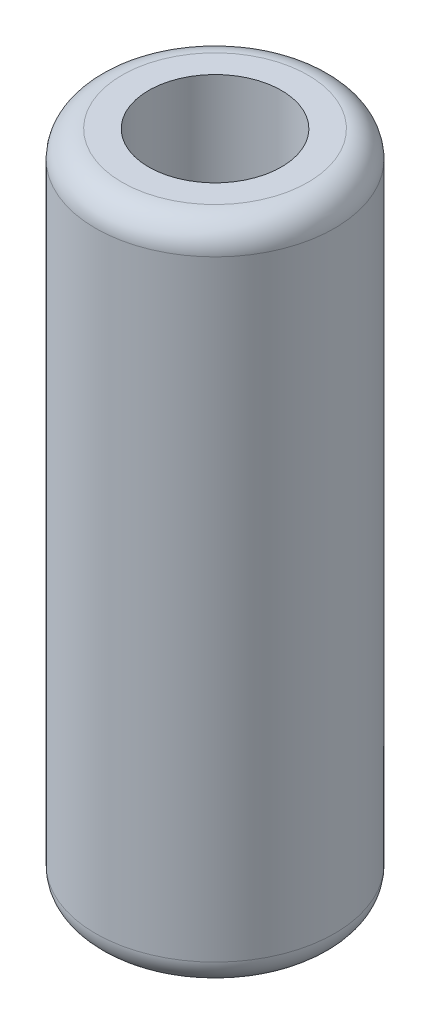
ISO-10303-21;
HEADER;
FILE_DESCRIPTION(('STEP AP214'),'2;1');
FILE_NAME('part.step','',(''),(''),'','','');
FILE_SCHEMA(('AUTOMOTIVE_DESIGN { 1 0 10303 214 1 1 1 1 }'));
ENDSEC;
DATA;
#1=APPLICATION_CONTEXT('core data for automotive mechanical design processes');
#2=APPLICATION_PROTOCOL_DEFINITION('international standard','automotive_design',2000,#1);
#3=PRODUCT_CONTEXT('',#1,'mechanical');
#4=PRODUCT('Part','Part','',(#3));
#5=PRODUCT_RELATED_PRODUCT_CATEGORY('part','',(#4));
#6=PRODUCT_DEFINITION_FORMATION('','',#4);
#7=PRODUCT_DEFINITION_CONTEXT('part definition',#1,'design');
#8=PRODUCT_DEFINITION('design','',#6,#7);
#9=PRODUCT_DEFINITION_SHAPE('','',#8);
#10=(LENGTH_UNIT() NAMED_UNIT(*) SI_UNIT(.MILLI.,.METRE.));
#11=(NAMED_UNIT(*) PLANE_ANGLE_UNIT() SI_UNIT($,.RADIAN.));
#12=(NAMED_UNIT(*) SI_UNIT($,.STERADIAN.) SOLID_ANGLE_UNIT());
#13=UNCERTAINTY_MEASURE_WITH_UNIT(LENGTH_MEASURE(1.E-05),#10,'distance_accuracy_value','');
#14=(GEOMETRIC_REPRESENTATION_CONTEXT(3) GLOBAL_UNCERTAINTY_ASSIGNED_CONTEXT((#13)) GLOBAL_UNIT_ASSIGNED_CONTEXT((#10,
#11,#12)) REPRESENTATION_CONTEXT('',''));
#15=CARTESIAN_POINT('',(0.,0.,0.));
#16=DIRECTION('',(0.,0.,1.));
#17=DIRECTION('',(1.,0.,0.));
#18=AXIS2_PLACEMENT_3D('',#15,#16,#17);
#19=CARTESIAN_POINT('',(0.,25.,0.));
#20=DIRECTION('',(0.,1.,0.));
#21=DIRECTION('',(0.,0.,1.));
#22=AXIS2_PLACEMENT_3D('',#19,#20,#21);
#23=PLANE('',#22);
#24=CARTESIAN_POINT('',(0.,25.,0.));
#25=DIRECTION('',(0.,1.,0.));
#26=DIRECTION('',(0.,0.,1.));
#27=AXIS2_PLACEMENT_3D('',#24,#25,#26);
#28=CIRCLE('',#27,3.5);
#29=CARTESIAN_POINT('',(0.,25.,3.5));
#30=VERTEX_POINT('',#29);
#31=EDGE_CURVE('E48',#30,#30,#28,.T.);
#32=ORIENTED_EDGE('',*,*,#31,.T.);
#33=EDGE_LOOP('',(#32));
#34=FACE_BOUND('',#33,.T.);
#35=CARTESIAN_POINT('',(0.,25.,0.));
#36=DIRECTION('',(0.,1.,0.));
#37=DIRECTION('',(0.,0.,1.));
#38=AXIS2_PLACEMENT_3D('',#35,#36,#37);
#39=CIRCLE('',#38,2.5);
#40=CARTESIAN_POINT('',(0.,25.,2.5));
#41=VERTEX_POINT('',#40);
#42=EDGE_CURVE('E51',#41,#41,#39,.T.);
#43=ORIENTED_EDGE('',*,*,#42,.F.);
#44=EDGE_LOOP('',(#43));
#45=FACE_BOUND('',#44,.T.);
#46=ADVANCED_FACE('F31',(#34,#45),#23,.T.);
#47=CARTESIAN_POINT('',(0.,25.,0.));
#48=DIRECTION('',(0.,-1.,0.));
#49=DIRECTION('',(0.,0.,-1.));
#50=AXIS2_PLACEMENT_3D('',#47,#48,#49);
#51=CYLINDRICAL_SURFACE('',#50,4.5);
#52=CARTESIAN_POINT('',(0.,24.,0.));
#53=DIRECTION('',(0.,1.,0.));
#54=DIRECTION('',(0.,0.,1.));
#55=AXIS2_PLACEMENT_3D('',#52,#53,#54);
#56=CIRCLE('',#55,4.5);
#57=CARTESIAN_POINT('',(0.,24.,4.5));
#58=VERTEX_POINT('',#57);
#59=EDGE_CURVE('E39',#58,#58,#56,.F.);
#60=ORIENTED_EDGE('',*,*,#59,.T.);
#61=EDGE_LOOP('',(#60));
#62=FACE_BOUND('',#61,.T.);
#63=CARTESIAN_POINT('',(0.,1.,0.));
#64=DIRECTION('',(0.,1.,0.));
#65=DIRECTION('',(0.,0.,1.));
#66=AXIS2_PLACEMENT_3D('',#63,#64,#65);
#67=CIRCLE('',#66,4.5);
#68=CARTESIAN_POINT('',(0.,1.,4.5));
#69=VERTEX_POINT('',#68);
#70=EDGE_CURVE('E43',#69,#69,#67,.T.);
#71=ORIENTED_EDGE('',*,*,#70,.T.);
#72=EDGE_LOOP('',(#71));
#73=FACE_BOUND('',#72,.T.);
#74=ADVANCED_FACE('F72',(#62,#73),#51,.T.);
#75=CARTESIAN_POINT('',(0.,25.,0.));
#76=DIRECTION('',(0.,-1.,0.));
#77=DIRECTION('',(0.,0.,-1.));
#78=AXIS2_PLACEMENT_3D('',#75,#76,#77);
#79=CYLINDRICAL_SURFACE('',#78,2.5);
#80=CARTESIAN_POINT('',(0.,1.,0.));
#81=DIRECTION('',(0.,1.,0.));
#82=DIRECTION('',(0.,0.,1.));
#83=AXIS2_PLACEMENT_3D('',#80,#81,#82);
#84=CIRCLE('',#83,2.5);
#85=CARTESIAN_POINT('',(0.,1.,2.5));
#86=VERTEX_POINT('',#85);
#87=EDGE_CURVE('E10',#86,#86,#84,.F.);
#88=ORIENTED_EDGE('',*,*,#87,.T.);
#89=EDGE_LOOP('',(#88));
#90=FACE_BOUND('',#89,.T.);
#91=ORIENTED_EDGE('',*,*,#42,.T.);
#92=EDGE_LOOP('',(#91));
#93=FACE_BOUND('',#92,.T.);
#94=ADVANCED_FACE('F68',(#90,#93),#79,.F.);
#95=CARTESIAN_POINT('',(0.,24.,0.));
#96=DIRECTION('',(0.,1.,0.));
#97=DIRECTION('',(0.,0.,1.));
#98=AXIS2_PLACEMENT_3D('',#95,#96,#97);
#99=TOROIDAL_SURFACE('',#98,3.5,1.);
#100=ORIENTED_EDGE('',*,*,#59,.F.);
#101=EDGE_LOOP('',(#100));
#102=FACE_BOUND('',#101,.T.);
#103=ORIENTED_EDGE('',*,*,#31,.F.);
#104=EDGE_LOOP('',(#103));
#105=FACE_BOUND('',#104,.T.);
#106=ADVANCED_FACE('F62',(#102,#105),#99,.T.);
#107=CARTESIAN_POINT('',(0.,1.,0.));
#108=DIRECTION('',(0.,1.,0.));
#109=DIRECTION('',(0.,0.,1.));
#110=AXIS2_PLACEMENT_3D('',#107,#108,#109);
#111=TOROIDAL_SURFACE('',#110,3.5,1.);
#112=ORIENTED_EDGE('',*,*,#87,.F.);
#113=EDGE_LOOP('',(#112));
#114=FACE_BOUND('',#113,.T.);
#115=CARTESIAN_POINT('',(0.,0.,0.));
#116=DIRECTION('',(0.,1.,0.));
#117=DIRECTION('',(0.,0.,1.));
#118=AXIS2_PLACEMENT_3D('',#115,#116,#117);
#119=CIRCLE('',#118,3.5);
#120=CARTESIAN_POINT('',(0.,0.,3.5));
#121=VERTEX_POINT('',#120);
#122=EDGE_CURVE('E35',#121,#121,#119,.T.);
#123=ORIENTED_EDGE('',*,*,#122,.F.);
#124=EDGE_LOOP('',(#123));
#125=FACE_BOUND('',#124,.T.);
#126=ADVANCED_FACE('F33',(#114,#125),#111,.T.);
#127=CARTESIAN_POINT('',(0.,1.,0.));
#128=DIRECTION('',(0.,1.,0.));
#129=DIRECTION('',(0.,0.,1.));
#130=AXIS2_PLACEMENT_3D('',#127,#128,#129);
#131=TOROIDAL_SURFACE('',#130,3.5,1.);
#132=ORIENTED_EDGE('',*,*,#122,.T.);
#133=EDGE_LOOP('',(#132));
#134=FACE_BOUND('',#133,.T.);
#135=ORIENTED_EDGE('',*,*,#70,.F.);
#136=EDGE_LOOP('',(#135));
#137=FACE_BOUND('',#136,.T.);
#138=ADVANCED_FACE('F58',(#134,#137),#131,.T.);
#139=CLOSED_SHELL('',(#46,#74,#94,#106,#126,#138));
#140=MANIFOLD_SOLID_BREP('B2',#139);
#141=ADVANCED_BREP_SHAPE_REPRESENTATION('',(#18,#140),#14);
#142=SHAPE_DEFINITION_REPRESENTATION(#9,#141);
ENDSEC;
END-ISO-10303-21;
